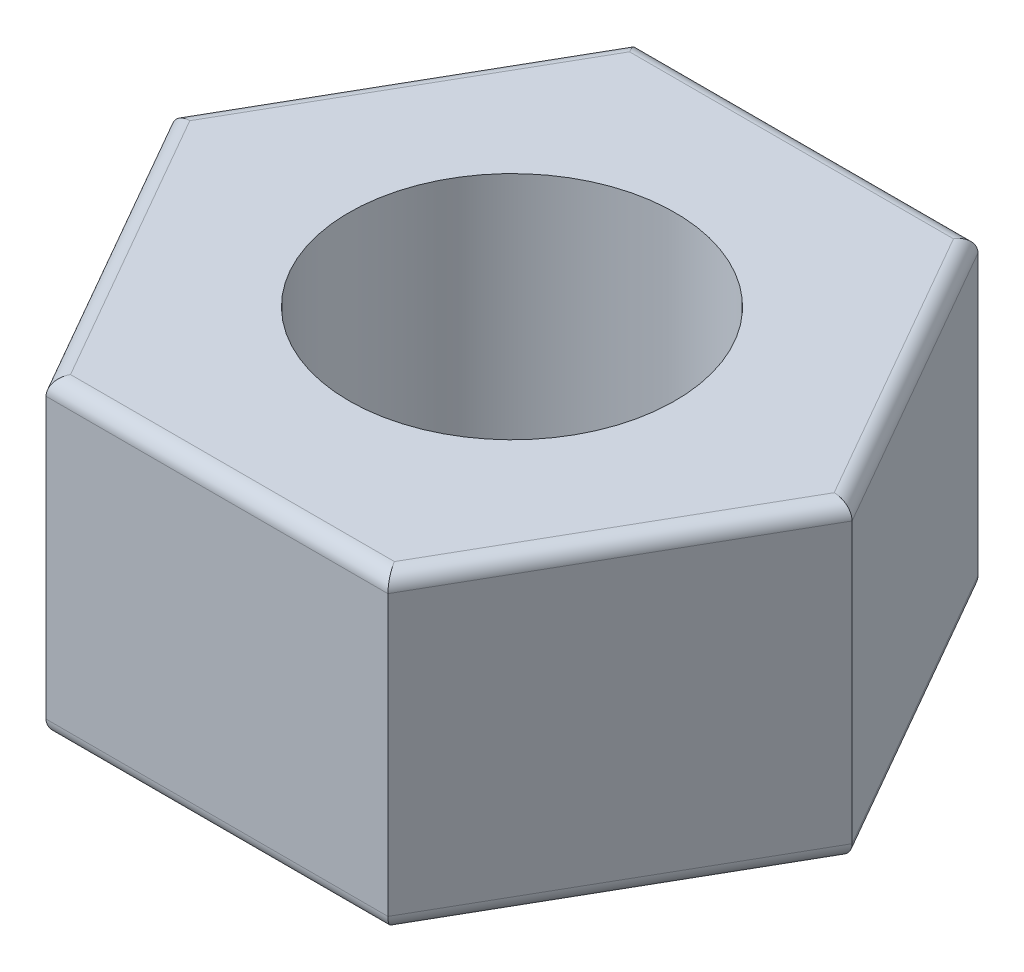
from build123d import *

# Parameters (mm, degrees)
ESQUISSE1_R      = 5.25
EXTRUSION1_DEPTH = 10
CONG_1_R         = 0.5


with BuildPart() as part:
    # Esquisse1 → Extrusion1 (new body)
    with BuildSketch(Plane(origin=(0, 0, 0), x_dir=(1, 0, 0), z_dir=(0, 1, 0))):
        Polygon((-5.504589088, 9.5), (5.504589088, 9.5), (10.95, 0), (5.504589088, -9.5), (-5.504589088, -9.5), (-10.95, 0), align=None)
        with Locations(Location((0, 0, 0), (0, 0, 270))):
            Circle(ESQUISSE1_R, mode=Mode.SUBTRACT)
    extrude(amount=EXTRUSION1_DEPTH)

    # Cong_1
    cong_1_edges = [part.edges().sort_by_distance(p)[0] for p in [
        (8.227294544, 10, -4.75),
        (0, 10, -9.5),
        (-8.227294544, 10, -4.75),
        (-8.227294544, 10, 4.75),
        (0, 10, 9.5),
        (-8.227294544, 0, 4.75),
        (-8.227294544, 0, -4.75),
        (0, 0, -9.5),
        (8.227294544, 0, -4.75),
        (8.227294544, 10, 4.75),
        (8.227294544, 0, 4.75),
        (0, 0, 9.5),
    ]]
    fillet(cong_1_edges, radius=CONG_1_R)


solid = part.part
